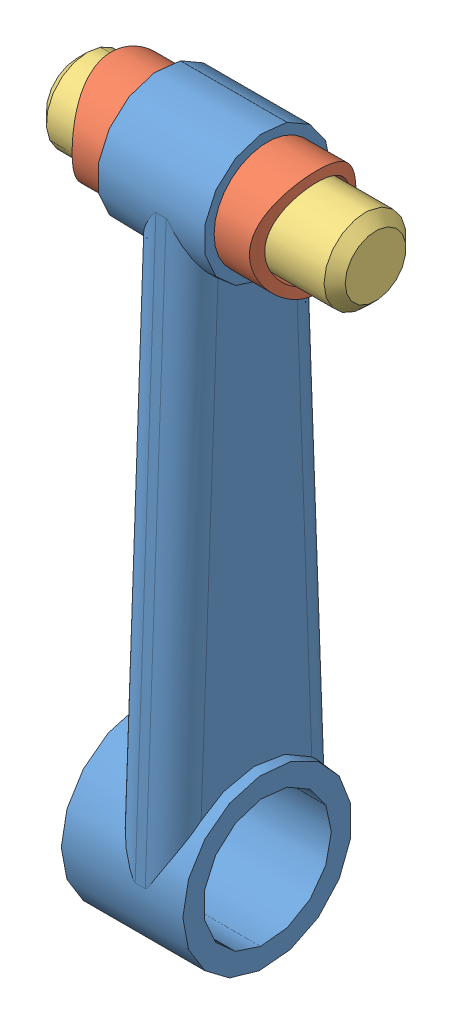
SolidWorks assembly connectingrod_asm.SLDASM, configuration Default (file format 4100). Lengths in mm.
Overall size (29.64 71.84 16.76).
4 component instances, 3 part files, 0 mates.
Components (placement in the parent):
- connectingrod_-1: connectingrod_.sldprt [Default] at (0.017 14.8166 0) x (0 0 -1) z (1 0 0) size (16.76 71.84 12.06)
- spacer_-1: spacer_.sldprt [Default] at (-6.2991 71.9666 0) x (0 0 -1) z (-1 0 0) size (10.57 10.57 4.91)
- spacer_-2: spacer_.sldprt [Default] at (4.2673 71.9666 0) x (0 0 -1) z (1 0 0) size (10.57 10.57 4.91)
- pistonpin_-1: pistonpin_.sldprt [Default] at (-14.6388 71.9666 0) x (0 1 0) z (1 0 0) size (8.13 8.13 29.64)
